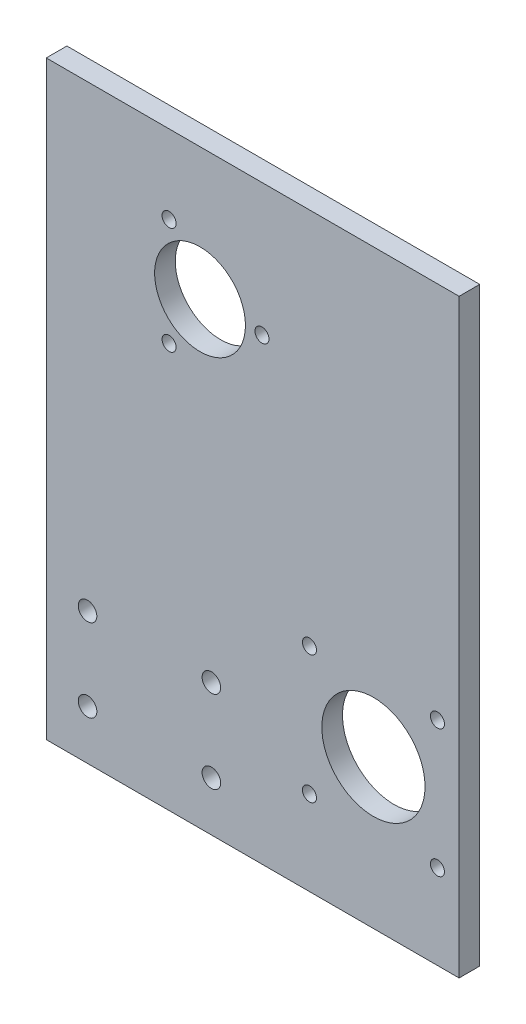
ISO-10303-21;
HEADER;
FILE_DESCRIPTION(('STEP AP214'),'2;1');
FILE_NAME('part.step','',(''),(''),'','','');
FILE_SCHEMA(('AUTOMOTIVE_DESIGN { 1 0 10303 214 1 1 1 1 }'));
ENDSEC;
DATA;
#1=APPLICATION_CONTEXT('core data for automotive mechanical design processes');
#2=APPLICATION_PROTOCOL_DEFINITION('international standard','automotive_design',2000,#1);
#3=PRODUCT_CONTEXT('',#1,'mechanical');
#4=PRODUCT('Part','Part','',(#3));
#5=PRODUCT_RELATED_PRODUCT_CATEGORY('part','',(#4));
#6=PRODUCT_DEFINITION_FORMATION('','',#4);
#7=PRODUCT_DEFINITION_CONTEXT('part definition',#1,'design');
#8=PRODUCT_DEFINITION('design','',#6,#7);
#9=PRODUCT_DEFINITION_SHAPE('','',#8);
#10=(LENGTH_UNIT() NAMED_UNIT(*) SI_UNIT(.MILLI.,.METRE.));
#11=(NAMED_UNIT(*) PLANE_ANGLE_UNIT() SI_UNIT($,.RADIAN.));
#12=(NAMED_UNIT(*) SI_UNIT($,.STERADIAN.) SOLID_ANGLE_UNIT());
#13=UNCERTAINTY_MEASURE_WITH_UNIT(LENGTH_MEASURE(1.E-05),#10,'distance_accuracy_value','');
#14=(GEOMETRIC_REPRESENTATION_CONTEXT(3) GLOBAL_UNCERTAINTY_ASSIGNED_CONTEXT((#13)) GLOBAL_UNIT_ASSIGNED_CONTEXT((#10,
#11,#12)) REPRESENTATION_CONTEXT('',''));
#15=CARTESIAN_POINT('',(0.,0.,0.));
#16=DIRECTION('',(0.,0.,1.));
#17=DIRECTION('',(1.,0.,0.));
#18=AXIS2_PLACEMENT_3D('',#15,#16,#17);
#19=CARTESIAN_POINT('',(50.,70.,5.));
#20=DIRECTION('',(-1.,0.,0.));
#21=DIRECTION('',(0.,-1.,0.));
#22=AXIS2_PLACEMENT_3D('',#19,#20,#21);
#23=PLANE('',#22);
#24=DIRECTION('',(0.,1.,0.));
#25=VECTOR('',#24,1.);
#26=CARTESIAN_POINT('',(50.,70.,0.));
#27=LINE('',#26,#25);
#28=CARTESIAN_POINT('',(50.,-70.,0.));
#29=VERTEX_POINT('',#28);
#30=CARTESIAN_POINT('',(50.,73.,0.));
#31=VERTEX_POINT('',#30);
#32=EDGE_CURVE('E178',#29,#31,#27,.T.);
#33=ORIENTED_EDGE('',*,*,#32,.T.);
#34=DIRECTION('',(0.,0.,-1.));
#35=VECTOR('',#34,1.);
#36=CARTESIAN_POINT('',(50.,73.,0.));
#37=LINE('',#36,#35);
#38=CARTESIAN_POINT('',(50.,73.,5.));
#39=VERTEX_POINT('',#38);
#40=EDGE_CURVE('E92',#39,#31,#37,.T.);
#41=ORIENTED_EDGE('',*,*,#40,.F.);
#42=DIRECTION('',(0.,1.,0.));
#43=VECTOR('',#42,1.);
#44=CARTESIAN_POINT('',(50.,70.,5.));
#45=LINE('',#44,#43);
#46=CARTESIAN_POINT('',(50.,-70.,5.));
#47=VERTEX_POINT('',#46);
#48=EDGE_CURVE('E83',#47,#39,#45,.T.);
#49=ORIENTED_EDGE('',*,*,#48,.F.);
#50=DIRECTION('',(0.,0.,-1.));
#51=VECTOR('',#50,1.);
#52=CARTESIAN_POINT('',(50.,-70.,5.));
#53=LINE('',#52,#51);
#54=EDGE_CURVE('E45',#47,#29,#53,.T.);
#55=ORIENTED_EDGE('',*,*,#54,.T.);
#56=EDGE_LOOP('',(#33,#41,#49,#55));
#57=FACE_BOUND('',#56,.T.);
#58=ADVANCED_FACE('F37',(#57),#23,.F.);
#59=CARTESIAN_POINT('',(-50.,70.,5.));
#60=DIRECTION('',(1.,0.,0.));
#61=DIRECTION('',(0.,0.,-1.));
#62=AXIS2_PLACEMENT_3D('',#59,#60,#61);
#63=PLANE('',#62);
#64=DIRECTION('',(0.,-1.,0.));
#65=VECTOR('',#64,1.);
#66=CARTESIAN_POINT('',(-50.,70.,0.));
#67=LINE('',#66,#65);
#68=CARTESIAN_POINT('',(-50.,73.,0.));
#69=VERTEX_POINT('',#68);
#70=CARTESIAN_POINT('',(-50.,-70.,0.));
#71=VERTEX_POINT('',#70);
#72=EDGE_CURVE('E64',#69,#71,#67,.T.);
#73=ORIENTED_EDGE('',*,*,#72,.T.);
#74=DIRECTION('',(0.,0.,-1.));
#75=VECTOR('',#74,1.);
#76=CARTESIAN_POINT('',(-50.,-70.,5.));
#77=LINE('',#76,#75);
#78=CARTESIAN_POINT('',(-50.,-70.,5.));
#79=VERTEX_POINT('',#78);
#80=EDGE_CURVE('E11',#79,#71,#77,.T.);
#81=ORIENTED_EDGE('',*,*,#80,.F.);
#82=DIRECTION('',(0.,-1.,0.));
#83=VECTOR('',#82,1.);
#84=CARTESIAN_POINT('',(-50.,70.,5.));
#85=LINE('',#84,#83);
#86=CARTESIAN_POINT('',(-50.,73.,5.));
#87=VERTEX_POINT('',#86);
#88=EDGE_CURVE('E78',#87,#79,#85,.T.);
#89=ORIENTED_EDGE('',*,*,#88,.F.);
#90=DIRECTION('',(0.,0.,1.));
#91=VECTOR('',#90,1.);
#92=CARTESIAN_POINT('',(-50.,73.,0.));
#93=LINE('',#92,#91);
#94=EDGE_CURVE('E82',#69,#87,#93,.T.);
#95=ORIENTED_EDGE('',*,*,#94,.F.);
#96=EDGE_LOOP('',(#73,#81,#89,#95));
#97=FACE_BOUND('',#96,.T.);
#98=ADVANCED_FACE('F80',(#97),#63,.F.);
#99=CARTESIAN_POINT('',(-50.,-70.,5.));
#100=DIRECTION('',(0.,1.,0.));
#101=DIRECTION('',(0.,0.,1.));
#102=AXIS2_PLACEMENT_3D('',#99,#100,#101);
#103=PLANE('',#102);
#104=DIRECTION('',(1.,0.,0.));
#105=VECTOR('',#104,1.);
#106=CARTESIAN_POINT('',(-50.,-70.,0.));
#107=LINE('',#106,#105);
#108=EDGE_CURVE('E179',#71,#29,#107,.T.);
#109=ORIENTED_EDGE('',*,*,#108,.T.);
#110=ORIENTED_EDGE('',*,*,#54,.F.);
#111=DIRECTION('',(1.,0.,0.));
#112=VECTOR('',#111,1.);
#113=CARTESIAN_POINT('',(-50.,-70.,5.));
#114=LINE('',#113,#112);
#115=EDGE_CURVE('E53',#79,#47,#114,.T.);
#116=ORIENTED_EDGE('',*,*,#115,.F.);
#117=ORIENTED_EDGE('',*,*,#80,.T.);
#118=EDGE_LOOP('',(#109,#110,#116,#117));
#119=FACE_BOUND('',#118,.T.);
#120=ADVANCED_FACE('F189',(#119),#103,.F.);
#121=CARTESIAN_POINT('',(0.,0.,5.));
#122=DIRECTION('',(0.,0.,1.));
#123=DIRECTION('',(1.,0.,0.));
#124=AXIS2_PLACEMENT_3D('',#121,#122,#123);
#125=PLANE('',#124);
#126=CARTESIAN_POINT('',(29.25,-34.,5.));
#127=DIRECTION('',(0.,0.,1.));
#128=DIRECTION('',(1.,0.,0.));
#129=AXIS2_PLACEMENT_3D('',#126,#127,#128);
#130=CIRCLE('',#129,12.5);
#131=CARTESIAN_POINT('',(41.75,-34.,5.));
#132=VERTEX_POINT('',#131);
#133=EDGE_CURVE('E100',#132,#132,#130,.T.);
#134=ORIENTED_EDGE('',*,*,#133,.F.);
#135=EDGE_LOOP('',(#134));
#136=FACE_BOUND('',#135,.T.);
#137=CARTESIAN_POINT('',(-12.75,41.,5.));
#138=DIRECTION('',(0.,0.,1.));
#139=DIRECTION('',(1.,0.,0.));
#140=AXIS2_PLACEMENT_3D('',#137,#138,#139);
#141=CIRCLE('',#140,11.);
#142=CARTESIAN_POINT('',(-1.75,41.,5.));
#143=VERTEX_POINT('',#142);
#144=EDGE_CURVE('E104',#143,#143,#141,.T.);
#145=ORIENTED_EDGE('',*,*,#144,.F.);
#146=EDGE_LOOP('',(#145));
#147=FACE_BOUND('',#146,.T.);
#148=CARTESIAN_POINT('',(13.75,-18.5,5.));
#149=DIRECTION('',(0.,0.,1.));
#150=DIRECTION('',(1.,0.,0.));
#151=AXIS2_PLACEMENT_3D('',#148,#149,#150);
#152=CIRCLE('',#151,1.7);
#153=CARTESIAN_POINT('',(15.45,-18.5,5.));
#154=VERTEX_POINT('',#153);
#155=EDGE_CURVE('E110',#154,#154,#152,.T.);
#156=ORIENTED_EDGE('',*,*,#155,.F.);
#157=EDGE_LOOP('',(#156));
#158=FACE_BOUND('',#157,.T.);
#159=CARTESIAN_POINT('',(44.75,-18.5,5.));
#160=DIRECTION('',(0.,0.,1.));
#161=DIRECTION('',(1.,0.,0.));
#162=AXIS2_PLACEMENT_3D('',#159,#160,#161);
#163=CIRCLE('',#162,1.7);
#164=CARTESIAN_POINT('',(46.45,-18.5,5.));
#165=VERTEX_POINT('',#164);
#166=EDGE_CURVE('E118',#165,#165,#163,.T.);
#167=ORIENTED_EDGE('',*,*,#166,.F.);
#168=EDGE_LOOP('',(#167));
#169=FACE_BOUND('',#168,.T.);
#170=CARTESIAN_POINT('',(13.75,-49.5,5.));
#171=DIRECTION('',(0.,0.,1.));
#172=DIRECTION('',(1.,0.,0.));
#173=AXIS2_PLACEMENT_3D('',#170,#171,#172);
#174=CIRCLE('',#173,1.7);
#175=CARTESIAN_POINT('',(15.45,-49.5,5.));
#176=VERTEX_POINT('',#175);
#177=EDGE_CURVE('E124',#176,#176,#174,.T.);
#178=ORIENTED_EDGE('',*,*,#177,.F.);
#179=EDGE_LOOP('',(#178));
#180=FACE_BOUND('',#179,.T.);
#181=CARTESIAN_POINT('',(44.75,-49.5,5.));
#182=DIRECTION('',(0.,0.,1.));
#183=DIRECTION('',(1.,0.,0.));
#184=AXIS2_PLACEMENT_3D('',#181,#182,#183);
#185=CIRCLE('',#184,1.7);
#186=CARTESIAN_POINT('',(46.45,-49.5,5.));
#187=VERTEX_POINT('',#186);
#188=EDGE_CURVE('E130',#187,#187,#185,.T.);
#189=ORIENTED_EDGE('',*,*,#188,.F.);
#190=EDGE_LOOP('',(#189));
#191=FACE_BOUND('',#190,.T.);
#192=CARTESIAN_POINT('',(-20.25,53.9903810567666,5.));
#193=DIRECTION('',(0.,0.,1.));
#194=DIRECTION('',(1.,0.,0.));
#195=AXIS2_PLACEMENT_3D('',#192,#193,#194);
#196=CIRCLE('',#195,1.7);
#197=CARTESIAN_POINT('',(-18.55,53.9903810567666,5.));
#198=VERTEX_POINT('',#197);
#199=EDGE_CURVE('E136',#198,#198,#196,.T.);
#200=ORIENTED_EDGE('',*,*,#199,.F.);
#201=EDGE_LOOP('',(#200));
#202=FACE_BOUND('',#201,.T.);
#203=CARTESIAN_POINT('',(2.25,41.,5.));
#204=DIRECTION('',(0.,0.,1.));
#205=DIRECTION('',(1.,0.,0.));
#206=AXIS2_PLACEMENT_3D('',#203,#204,#205);
#207=CIRCLE('',#206,1.7);
#208=CARTESIAN_POINT('',(3.95,41.,5.));
#209=VERTEX_POINT('',#208);
#210=EDGE_CURVE('E142',#209,#209,#207,.T.);
#211=ORIENTED_EDGE('',*,*,#210,.F.);
#212=EDGE_LOOP('',(#211));
#213=FACE_BOUND('',#212,.T.);
#214=CARTESIAN_POINT('',(-20.25,28.0096189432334,5.));
#215=DIRECTION('',(0.,0.,1.));
#216=DIRECTION('',(1.,0.,0.));
#217=AXIS2_PLACEMENT_3D('',#214,#215,#216);
#218=CIRCLE('',#217,1.7);
#219=CARTESIAN_POINT('',(-18.55,28.0096189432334,5.));
#220=VERTEX_POINT('',#219);
#221=EDGE_CURVE('E148',#220,#220,#218,.T.);
#222=ORIENTED_EDGE('',*,*,#221,.F.);
#223=EDGE_LOOP('',(#222));
#224=FACE_BOUND('',#223,.T.);
#225=CARTESIAN_POINT('',(-40.,-38.,5.));
#226=DIRECTION('',(0.,0.,1.));
#227=DIRECTION('',(1.,0.,0.));
#228=AXIS2_PLACEMENT_3D('',#225,#226,#227);
#229=CIRCLE('',#228,2.25);
#230=CARTESIAN_POINT('',(-37.75,-38.,5.));
#231=VERTEX_POINT('',#230);
#232=EDGE_CURVE('E154',#231,#231,#229,.T.);
#233=ORIENTED_EDGE('',*,*,#232,.F.);
#234=EDGE_LOOP('',(#233));
#235=FACE_BOUND('',#234,.T.);
#236=CARTESIAN_POINT('',(-9.99999999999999,-38.,5.));
#237=DIRECTION('',(0.,0.,1.));
#238=DIRECTION('',(1.,0.,0.));
#239=AXIS2_PLACEMENT_3D('',#236,#237,#238);
#240=CIRCLE('',#239,2.25);
#241=CARTESIAN_POINT('',(-7.74999999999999,-38.,5.));
#242=VERTEX_POINT('',#241);
#243=EDGE_CURVE('E160',#242,#242,#240,.T.);
#244=ORIENTED_EDGE('',*,*,#243,.F.);
#245=EDGE_LOOP('',(#244));
#246=FACE_BOUND('',#245,.T.);
#247=CARTESIAN_POINT('',(-40.,-58.,5.));
#248=DIRECTION('',(0.,0.,1.));
#249=DIRECTION('',(1.,0.,0.));
#250=AXIS2_PLACEMENT_3D('',#247,#248,#249);
#251=CIRCLE('',#250,2.25);
#252=CARTESIAN_POINT('',(-37.75,-58.,5.));
#253=VERTEX_POINT('',#252);
#254=EDGE_CURVE('E166',#253,#253,#251,.T.);
#255=ORIENTED_EDGE('',*,*,#254,.F.);
#256=EDGE_LOOP('',(#255));
#257=FACE_BOUND('',#256,.T.);
#258=CARTESIAN_POINT('',(-9.99999999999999,-58.,5.));
#259=DIRECTION('',(0.,0.,1.));
#260=DIRECTION('',(1.,0.,0.));
#261=AXIS2_PLACEMENT_3D('',#258,#259,#260);
#262=CIRCLE('',#261,2.25);
#263=CARTESIAN_POINT('',(-7.74999999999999,-58.,5.));
#264=VERTEX_POINT('',#263);
#265=EDGE_CURVE('E172',#264,#264,#262,.T.);
#266=ORIENTED_EDGE('',*,*,#265,.F.);
#267=EDGE_LOOP('',(#266));
#268=FACE_BOUND('',#267,.T.);
#269=ORIENTED_EDGE('',*,*,#48,.T.);
#270=DIRECTION('',(1.,0.,0.));
#271=VECTOR('',#270,1.);
#272=CARTESIAN_POINT('',(-50.,73.,5.));
#273=LINE('',#272,#271);
#274=EDGE_CURVE('E86',#87,#39,#273,.T.);
#275=ORIENTED_EDGE('',*,*,#274,.F.);
#276=ORIENTED_EDGE('',*,*,#88,.T.);
#277=ORIENTED_EDGE('',*,*,#115,.T.);
#278=EDGE_LOOP('',(#269,#275,#276,#277));
#279=FACE_BOUND('',#278,.T.);
#280=ADVANCED_FACE('F87',(#136,#147,#158,#169,#180,#191,#202,#213,#224,#235,#246,#257,#268,
#279),#125,.T.);
#281=CARTESIAN_POINT('',(0.,0.,0.));
#282=DIRECTION('',(0.,0.,1.));
#283=DIRECTION('',(1.,0.,0.));
#284=AXIS2_PLACEMENT_3D('',#281,#282,#283);
#285=PLANE('',#284);
#286=CARTESIAN_POINT('',(29.25,-34.,0.));
#287=DIRECTION('',(0.,0.,1.));
#288=DIRECTION('',(1.,0.,0.));
#289=AXIS2_PLACEMENT_3D('',#286,#287,#288);
#290=CIRCLE('',#289,12.5);
#291=CARTESIAN_POINT('',(41.75,-34.,0.));
#292=VERTEX_POINT('',#291);
#293=EDGE_CURVE('E101',#292,#292,#290,.T.);
#294=ORIENTED_EDGE('',*,*,#293,.T.);
#295=EDGE_LOOP('',(#294));
#296=FACE_BOUND('',#295,.T.);
#297=CARTESIAN_POINT('',(-12.75,41.,0.));
#298=DIRECTION('',(0.,0.,1.));
#299=DIRECTION('',(1.,0.,0.));
#300=AXIS2_PLACEMENT_3D('',#297,#298,#299);
#301=CIRCLE('',#300,11.);
#302=CARTESIAN_POINT('',(-1.75,41.,0.));
#303=VERTEX_POINT('',#302);
#304=EDGE_CURVE('E107',#303,#303,#301,.T.);
#305=ORIENTED_EDGE('',*,*,#304,.T.);
#306=EDGE_LOOP('',(#305));
#307=FACE_BOUND('',#306,.T.);
#308=CARTESIAN_POINT('',(13.75,-18.5,0.));
#309=DIRECTION('',(0.,0.,1.));
#310=DIRECTION('',(1.,0.,0.));
#311=AXIS2_PLACEMENT_3D('',#308,#309,#310);
#312=CIRCLE('',#311,1.7);
#313=CARTESIAN_POINT('',(15.45,-18.5,0.));
#314=VERTEX_POINT('',#313);
#315=EDGE_CURVE('E115',#314,#314,#312,.T.);
#316=ORIENTED_EDGE('',*,*,#315,.T.);
#317=EDGE_LOOP('',(#316));
#318=FACE_BOUND('',#317,.T.);
#319=CARTESIAN_POINT('',(44.75,-18.5,0.));
#320=DIRECTION('',(0.,0.,1.));
#321=DIRECTION('',(1.,0.,0.));
#322=AXIS2_PLACEMENT_3D('',#319,#320,#321);
#323=CIRCLE('',#322,1.7);
#324=CARTESIAN_POINT('',(46.45,-18.5,0.));
#325=VERTEX_POINT('',#324);
#326=EDGE_CURVE('E121',#325,#325,#323,.T.);
#327=ORIENTED_EDGE('',*,*,#326,.T.);
#328=EDGE_LOOP('',(#327));
#329=FACE_BOUND('',#328,.T.);
#330=CARTESIAN_POINT('',(13.75,-49.5,0.));
#331=DIRECTION('',(0.,0.,1.));
#332=DIRECTION('',(1.,0.,0.));
#333=AXIS2_PLACEMENT_3D('',#330,#331,#332);
#334=CIRCLE('',#333,1.7);
#335=CARTESIAN_POINT('',(15.45,-49.5,0.));
#336=VERTEX_POINT('',#335);
#337=EDGE_CURVE('E127',#336,#336,#334,.T.);
#338=ORIENTED_EDGE('',*,*,#337,.T.);
#339=EDGE_LOOP('',(#338));
#340=FACE_BOUND('',#339,.T.);
#341=CARTESIAN_POINT('',(44.75,-49.5,0.));
#342=DIRECTION('',(0.,0.,1.));
#343=DIRECTION('',(1.,0.,0.));
#344=AXIS2_PLACEMENT_3D('',#341,#342,#343);
#345=CIRCLE('',#344,1.7);
#346=CARTESIAN_POINT('',(46.45,-49.5,0.));
#347=VERTEX_POINT('',#346);
#348=EDGE_CURVE('E133',#347,#347,#345,.T.);
#349=ORIENTED_EDGE('',*,*,#348,.T.);
#350=EDGE_LOOP('',(#349));
#351=FACE_BOUND('',#350,.T.);
#352=CARTESIAN_POINT('',(-20.25,53.9903810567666,0.));
#353=DIRECTION('',(0.,0.,1.));
#354=DIRECTION('',(1.,0.,0.));
#355=AXIS2_PLACEMENT_3D('',#352,#353,#354);
#356=CIRCLE('',#355,1.7);
#357=CARTESIAN_POINT('',(-18.55,53.9903810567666,0.));
#358=VERTEX_POINT('',#357);
#359=EDGE_CURVE('E139',#358,#358,#356,.T.);
#360=ORIENTED_EDGE('',*,*,#359,.T.);
#361=EDGE_LOOP('',(#360));
#362=FACE_BOUND('',#361,.T.);
#363=CARTESIAN_POINT('',(2.25,41.,0.));
#364=DIRECTION('',(0.,0.,1.));
#365=DIRECTION('',(1.,0.,0.));
#366=AXIS2_PLACEMENT_3D('',#363,#364,#365);
#367=CIRCLE('',#366,1.7);
#368=CARTESIAN_POINT('',(3.95,41.,0.));
#369=VERTEX_POINT('',#368);
#370=EDGE_CURVE('E145',#369,#369,#367,.T.);
#371=ORIENTED_EDGE('',*,*,#370,.T.);
#372=EDGE_LOOP('',(#371));
#373=FACE_BOUND('',#372,.T.);
#374=CARTESIAN_POINT('',(-20.25,28.0096189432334,0.));
#375=DIRECTION('',(0.,0.,1.));
#376=DIRECTION('',(1.,0.,0.));
#377=AXIS2_PLACEMENT_3D('',#374,#375,#376);
#378=CIRCLE('',#377,1.7);
#379=CARTESIAN_POINT('',(-18.55,28.0096189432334,0.));
#380=VERTEX_POINT('',#379);
#381=EDGE_CURVE('E151',#380,#380,#378,.T.);
#382=ORIENTED_EDGE('',*,*,#381,.T.);
#383=EDGE_LOOP('',(#382));
#384=FACE_BOUND('',#383,.T.);
#385=CARTESIAN_POINT('',(-40.,-38.,0.));
#386=DIRECTION('',(0.,0.,1.));
#387=DIRECTION('',(1.,0.,0.));
#388=AXIS2_PLACEMENT_3D('',#385,#386,#387);
#389=CIRCLE('',#388,2.25);
#390=CARTESIAN_POINT('',(-37.75,-38.,0.));
#391=VERTEX_POINT('',#390);
#392=EDGE_CURVE('E157',#391,#391,#389,.T.);
#393=ORIENTED_EDGE('',*,*,#392,.T.);
#394=EDGE_LOOP('',(#393));
#395=FACE_BOUND('',#394,.T.);
#396=CARTESIAN_POINT('',(-9.99999999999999,-38.,0.));
#397=DIRECTION('',(0.,0.,1.));
#398=DIRECTION('',(1.,0.,0.));
#399=AXIS2_PLACEMENT_3D('',#396,#397,#398);
#400=CIRCLE('',#399,2.25);
#401=CARTESIAN_POINT('',(-7.74999999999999,-38.,0.));
#402=VERTEX_POINT('',#401);
#403=EDGE_CURVE('E163',#402,#402,#400,.T.);
#404=ORIENTED_EDGE('',*,*,#403,.T.);
#405=EDGE_LOOP('',(#404));
#406=FACE_BOUND('',#405,.T.);
#407=CARTESIAN_POINT('',(-40.,-58.,0.));
#408=DIRECTION('',(0.,0.,1.));
#409=DIRECTION('',(1.,0.,0.));
#410=AXIS2_PLACEMENT_3D('',#407,#408,#409);
#411=CIRCLE('',#410,2.25);
#412=CARTESIAN_POINT('',(-37.75,-58.,0.));
#413=VERTEX_POINT('',#412);
#414=EDGE_CURVE('E169',#413,#413,#411,.T.);
#415=ORIENTED_EDGE('',*,*,#414,.T.);
#416=EDGE_LOOP('',(#415));
#417=FACE_BOUND('',#416,.T.);
#418=CARTESIAN_POINT('',(-9.99999999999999,-58.,0.));
#419=DIRECTION('',(0.,0.,1.));
#420=DIRECTION('',(1.,0.,0.));
#421=AXIS2_PLACEMENT_3D('',#418,#419,#420);
#422=CIRCLE('',#421,2.25);
#423=CARTESIAN_POINT('',(-7.74999999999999,-58.,0.));
#424=VERTEX_POINT('',#423);
#425=EDGE_CURVE('E175',#424,#424,#422,.T.);
#426=ORIENTED_EDGE('',*,*,#425,.T.);
#427=EDGE_LOOP('',(#426));
#428=FACE_BOUND('',#427,.T.);
#429=ORIENTED_EDGE('',*,*,#32,.F.);
#430=ORIENTED_EDGE('',*,*,#108,.F.);
#431=ORIENTED_EDGE('',*,*,#72,.F.);
#432=DIRECTION('',(-1.,0.,0.));
#433=VECTOR('',#432,1.);
#434=CARTESIAN_POINT('',(-50.,73.,0.));
#435=LINE('',#434,#433);
#436=EDGE_CURVE('E95',#31,#69,#435,.T.);
#437=ORIENTED_EDGE('',*,*,#436,.F.);
#438=EDGE_LOOP('',(#429,#430,#431,#437));
#439=FACE_BOUND('',#438,.T.);
#440=ADVANCED_FACE('F188',(#296,#307,#318,#329,#340,#351,#362,#373,#384,#395,#406,#417,#428,
#439),#285,.F.);
#441=CARTESIAN_POINT('',(-9.99999999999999,-58.,5.));
#442=DIRECTION('',(0.,0.,1.));
#443=DIRECTION('',(1.,0.,0.));
#444=AXIS2_PLACEMENT_3D('',#441,#442,#443);
#445=CYLINDRICAL_SURFACE('',#444,2.25);
#446=ORIENTED_EDGE('',*,*,#425,.F.);
#447=EDGE_LOOP('',(#446));
#448=FACE_BOUND('',#447,.T.);
#449=ORIENTED_EDGE('',*,*,#265,.T.);
#450=EDGE_LOOP('',(#449));
#451=FACE_BOUND('',#450,.T.);
#452=ADVANCED_FACE('F224',(#448,#451),#445,.F.);
#453=CARTESIAN_POINT('',(-40.,-58.,5.));
#454=DIRECTION('',(0.,0.,1.));
#455=DIRECTION('',(1.,0.,0.));
#456=AXIS2_PLACEMENT_3D('',#453,#454,#455);
#457=CYLINDRICAL_SURFACE('',#456,2.25);
#458=ORIENTED_EDGE('',*,*,#414,.F.);
#459=EDGE_LOOP('',(#458));
#460=FACE_BOUND('',#459,.T.);
#461=ORIENTED_EDGE('',*,*,#254,.T.);
#462=EDGE_LOOP('',(#461));
#463=FACE_BOUND('',#462,.T.);
#464=ADVANCED_FACE('F323',(#460,#463),#457,.F.);
#465=CARTESIAN_POINT('',(-9.99999999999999,-38.,5.));
#466=DIRECTION('',(0.,0.,1.));
#467=DIRECTION('',(1.,0.,0.));
#468=AXIS2_PLACEMENT_3D('',#465,#466,#467);
#469=CYLINDRICAL_SURFACE('',#468,2.25);
#470=ORIENTED_EDGE('',*,*,#403,.F.);
#471=EDGE_LOOP('',(#470));
#472=FACE_BOUND('',#471,.T.);
#473=ORIENTED_EDGE('',*,*,#243,.T.);
#474=EDGE_LOOP('',(#473));
#475=FACE_BOUND('',#474,.T.);
#476=ADVANCED_FACE('F315',(#472,#475),#469,.F.);
#477=CARTESIAN_POINT('',(-40.,-38.,5.));
#478=DIRECTION('',(0.,0.,1.));
#479=DIRECTION('',(1.,0.,0.));
#480=AXIS2_PLACEMENT_3D('',#477,#478,#479);
#481=CYLINDRICAL_SURFACE('',#480,2.25);
#482=ORIENTED_EDGE('',*,*,#392,.F.);
#483=EDGE_LOOP('',(#482));
#484=FACE_BOUND('',#483,.T.);
#485=ORIENTED_EDGE('',*,*,#232,.T.);
#486=EDGE_LOOP('',(#485));
#487=FACE_BOUND('',#486,.T.);
#488=ADVANCED_FACE('F307',(#484,#487),#481,.F.);
#489=CARTESIAN_POINT('',(-20.25,28.0096189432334,5.));
#490=DIRECTION('',(0.,0.,1.));
#491=DIRECTION('',(1.,0.,0.));
#492=AXIS2_PLACEMENT_3D('',#489,#490,#491);
#493=CYLINDRICAL_SURFACE('',#492,1.7);
#494=ORIENTED_EDGE('',*,*,#381,.F.);
#495=EDGE_LOOP('',(#494));
#496=FACE_BOUND('',#495,.T.);
#497=ORIENTED_EDGE('',*,*,#221,.T.);
#498=EDGE_LOOP('',(#497));
#499=FACE_BOUND('',#498,.T.);
#500=ADVANCED_FACE('F299',(#496,#499),#493,.F.);
#501=CARTESIAN_POINT('',(2.25,41.,5.));
#502=DIRECTION('',(0.,0.,1.));
#503=DIRECTION('',(1.,0.,0.));
#504=AXIS2_PLACEMENT_3D('',#501,#502,#503);
#505=CYLINDRICAL_SURFACE('',#504,1.7);
#506=ORIENTED_EDGE('',*,*,#370,.F.);
#507=EDGE_LOOP('',(#506));
#508=FACE_BOUND('',#507,.T.);
#509=ORIENTED_EDGE('',*,*,#210,.T.);
#510=EDGE_LOOP('',(#509));
#511=FACE_BOUND('',#510,.T.);
#512=ADVANCED_FACE('F291',(#508,#511),#505,.F.);
#513=CARTESIAN_POINT('',(-20.25,53.9903810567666,5.));
#514=DIRECTION('',(0.,0.,1.));
#515=DIRECTION('',(1.,0.,0.));
#516=AXIS2_PLACEMENT_3D('',#513,#514,#515);
#517=CYLINDRICAL_SURFACE('',#516,1.7);
#518=ORIENTED_EDGE('',*,*,#359,.F.);
#519=EDGE_LOOP('',(#518));
#520=FACE_BOUND('',#519,.T.);
#521=ORIENTED_EDGE('',*,*,#199,.T.);
#522=EDGE_LOOP('',(#521));
#523=FACE_BOUND('',#522,.T.);
#524=ADVANCED_FACE('F283',(#520,#523),#517,.F.);
#525=CARTESIAN_POINT('',(44.75,-49.5,5.));
#526=DIRECTION('',(0.,0.,1.));
#527=DIRECTION('',(1.,0.,0.));
#528=AXIS2_PLACEMENT_3D('',#525,#526,#527);
#529=CYLINDRICAL_SURFACE('',#528,1.7);
#530=ORIENTED_EDGE('',*,*,#348,.F.);
#531=EDGE_LOOP('',(#530));
#532=FACE_BOUND('',#531,.T.);
#533=ORIENTED_EDGE('',*,*,#188,.T.);
#534=EDGE_LOOP('',(#533));
#535=FACE_BOUND('',#534,.T.);
#536=ADVANCED_FACE('F275',(#532,#535),#529,.F.);
#537=CARTESIAN_POINT('',(13.75,-49.5,5.));
#538=DIRECTION('',(0.,0.,1.));
#539=DIRECTION('',(1.,0.,0.));
#540=AXIS2_PLACEMENT_3D('',#537,#538,#539);
#541=CYLINDRICAL_SURFACE('',#540,1.7);
#542=ORIENTED_EDGE('',*,*,#337,.F.);
#543=EDGE_LOOP('',(#542));
#544=FACE_BOUND('',#543,.T.);
#545=ORIENTED_EDGE('',*,*,#177,.T.);
#546=EDGE_LOOP('',(#545));
#547=FACE_BOUND('',#546,.T.);
#548=ADVANCED_FACE('F267',(#544,#547),#541,.F.);
#549=CARTESIAN_POINT('',(44.75,-18.5,5.));
#550=DIRECTION('',(0.,0.,1.));
#551=DIRECTION('',(1.,0.,0.));
#552=AXIS2_PLACEMENT_3D('',#549,#550,#551);
#553=CYLINDRICAL_SURFACE('',#552,1.7);
#554=ORIENTED_EDGE('',*,*,#326,.F.);
#555=EDGE_LOOP('',(#554));
#556=FACE_BOUND('',#555,.T.);
#557=ORIENTED_EDGE('',*,*,#166,.T.);
#558=EDGE_LOOP('',(#557));
#559=FACE_BOUND('',#558,.T.);
#560=ADVANCED_FACE('F259',(#556,#559),#553,.F.);
#561=CARTESIAN_POINT('',(13.75,-18.5,5.));
#562=DIRECTION('',(0.,0.,1.));
#563=DIRECTION('',(1.,0.,0.));
#564=AXIS2_PLACEMENT_3D('',#561,#562,#563);
#565=CYLINDRICAL_SURFACE('',#564,1.7);
#566=ORIENTED_EDGE('',*,*,#315,.F.);
#567=EDGE_LOOP('',(#566));
#568=FACE_BOUND('',#567,.T.);
#569=ORIENTED_EDGE('',*,*,#155,.T.);
#570=EDGE_LOOP('',(#569));
#571=FACE_BOUND('',#570,.T.);
#572=ADVANCED_FACE('F251',(#568,#571),#565,.F.);
#573=CARTESIAN_POINT('',(-12.75,41.,0.));
#574=DIRECTION('',(0.,0.,1.));
#575=DIRECTION('',(1.,0.,0.));
#576=AXIS2_PLACEMENT_3D('',#573,#574,#575);
#577=CYLINDRICAL_SURFACE('',#576,11.);
#578=ORIENTED_EDGE('',*,*,#304,.F.);
#579=EDGE_LOOP('',(#578));
#580=FACE_BOUND('',#579,.T.);
#581=ORIENTED_EDGE('',*,*,#144,.T.);
#582=EDGE_LOOP('',(#581));
#583=FACE_BOUND('',#582,.T.);
#584=ADVANCED_FACE('F243',(#580,#583),#577,.F.);
#585=CARTESIAN_POINT('',(29.25,-34.,0.));
#586=DIRECTION('',(0.,0.,1.));
#587=DIRECTION('',(1.,0.,0.));
#588=AXIS2_PLACEMENT_3D('',#585,#586,#587);
#589=CYLINDRICAL_SURFACE('',#588,12.5);
#590=ORIENTED_EDGE('',*,*,#293,.F.);
#591=EDGE_LOOP('',(#590));
#592=FACE_BOUND('',#591,.T.);
#593=ORIENTED_EDGE('',*,*,#133,.T.);
#594=EDGE_LOOP('',(#593));
#595=FACE_BOUND('',#594,.T.);
#596=ADVANCED_FACE('F234',(#592,#595),#589,.F.);
#597=CARTESIAN_POINT('',(0.,73.,0.));
#598=DIRECTION('',(0.,1.,0.));
#599=DIRECTION('',(0.,0.,1.));
#600=AXIS2_PLACEMENT_3D('',#597,#598,#599);
#601=PLANE('',#600);
#602=ORIENTED_EDGE('',*,*,#94,.T.);
#603=ORIENTED_EDGE('',*,*,#274,.T.);
#604=ORIENTED_EDGE('',*,*,#40,.T.);
#605=ORIENTED_EDGE('',*,*,#436,.T.);
#606=EDGE_LOOP('',(#602,#603,#604,#605));
#607=FACE_BOUND('',#606,.T.);
#608=ADVANCED_FACE('F94',(#607),#601,.T.);
#609=CLOSED_SHELL('',(#58,#98,#120,#280,#440,#452,#464,#476,#488,#500,#512,#524,#536,#548,#560,
#572,#584,#596,#608));
#610=MANIFOLD_SOLID_BREP('B2',#609);
#611=ADVANCED_BREP_SHAPE_REPRESENTATION('',(#18,#610),#14);
#612=SHAPE_DEFINITION_REPRESENTATION(#9,#611);
ENDSEC;
END-ISO-10303-21;
